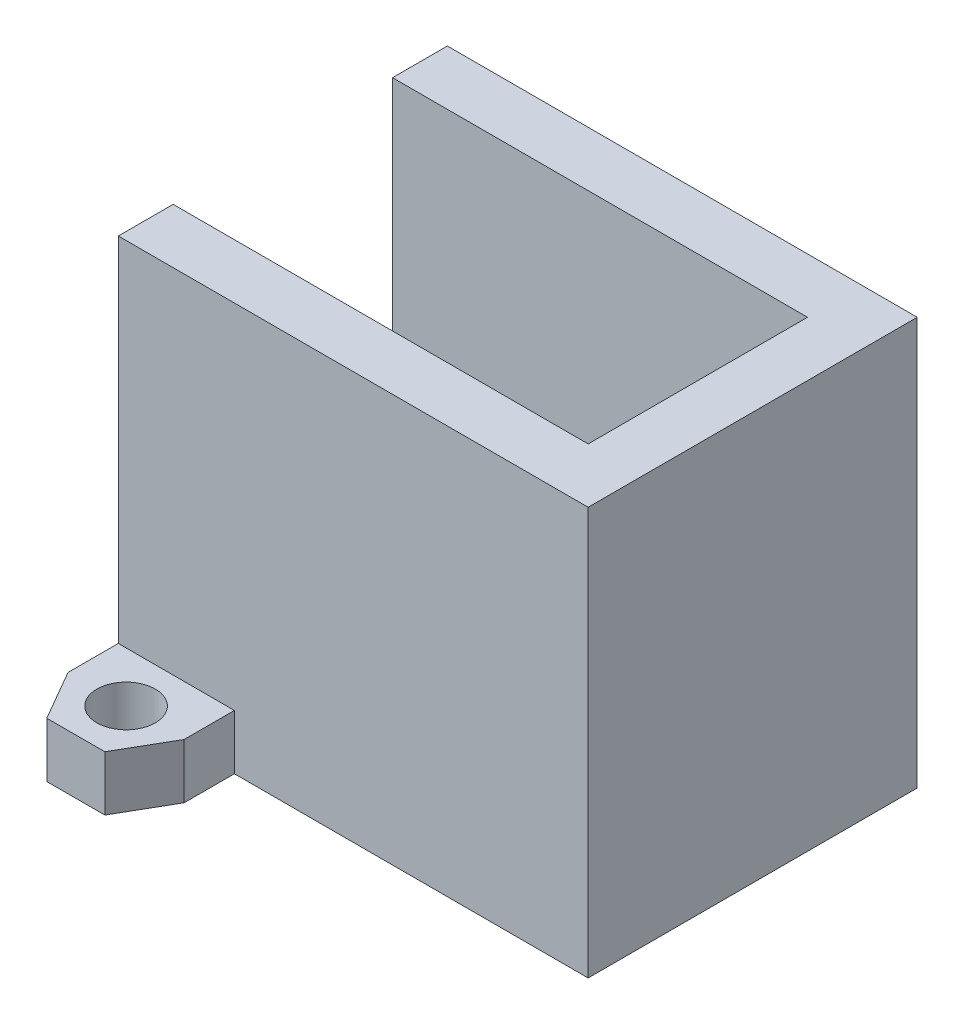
from build123d import *

# Parameters (mm, degrees)
SKETCH1_R           = 1.6
BOSS_EXTRUDE1_DEPTH = 3
BOSS_EXTRUDE2_DEPTH = 22.3


with BuildPart() as part:
    # Sketch1 → Boss-Extrude1 (new body)
    # profile 1 of 6: a face of its own
    with BuildSketch(Plane(origin=(0, 0, 0), x_dir=(1, 0, 0), z_dir=(0, 1, 0))):
        Polygon((-9.76228676, -9), (-11.35, -9), (-11.35, -11.75), align=None)
    # profile 2 of 6: a face of its own
    with BuildSketch(Plane(origin=(0, 0, 0), x_dir=(1, 0, 0), z_dir=(0, 1, 0))):
        Polygon((-6.586860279, -9), (-9.76228676, -9), (-11.35, -11.75), (-9.76228676, -14.5), (-6.586860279, -14.5), (-4.999147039, -11.75), align=None)
        with Locations(Location((-8.174573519, -11.75, 0), (0, 0, 270))):
            Circle(SKETCH1_R, mode=Mode.SUBTRACT)
    # profile 3 of 6: a face of its own
    with BuildSketch(Plane(origin=(0, 0, 0), x_dir=(1, 0, 0), z_dir=(0, 1, 0))):
        Polygon((-4.999147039, -11.75), (-4.999147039, -9), (-6.586860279, -9), align=None)
    # profile 4 of 6: a face of its own
    with BuildSketch(Plane(origin=(0, 0, 0), x_dir=(1, 0, 0), z_dir=(0, 1, 0))):
        Polygon((-11.35, 11.75), (-11.35, 9), (-9.76228676, 9), align=None)
    # profile 5 of 6: a face of its own
    with BuildSketch(Plane(origin=(0, 0, 0), x_dir=(1, 0, 0), z_dir=(0, 1, 0))):
        Polygon((-11.35, 11.75), (-9.76228676, 9), (-6.586860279, 9), (-4.999147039, 11.75), (-6.586860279, 14.5), (-9.76228676, 14.5), align=None)
        with Locations(Location((-8.174573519, 11.75, 0), (0, 0, 270))):
            Circle(SKETCH1_R, mode=Mode.SUBTRACT)
    # profile 6 of 6: a face of its own
    with BuildSketch(Plane(origin=(0, 0, 0), x_dir=(1, 0, 0), z_dir=(0, 1, 0))):
        Polygon((-4.999147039, 11.75), (-6.586860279, 9), (-4.999147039, 9), align=None)
    extrude(amount=BOSS_EXTRUDE1_DEPTH)

    # Sketch1_3 → Boss-Extrude2 (add)
    with BuildSketch(Plane(origin=(0, 0, 0), x_dir=(1, 0, 0), z_dir=(0, 1, 0))):
        Polygon((-11.35, -6), (11.35, -6), (11.35, 6), (-11.35, 6), (-11.35, 9), (14.35, 9), (14.35, -9), (-11.35, -9), align=None)
    extrude(amount=BOSS_EXTRUDE2_DEPTH)


solid = part.part
